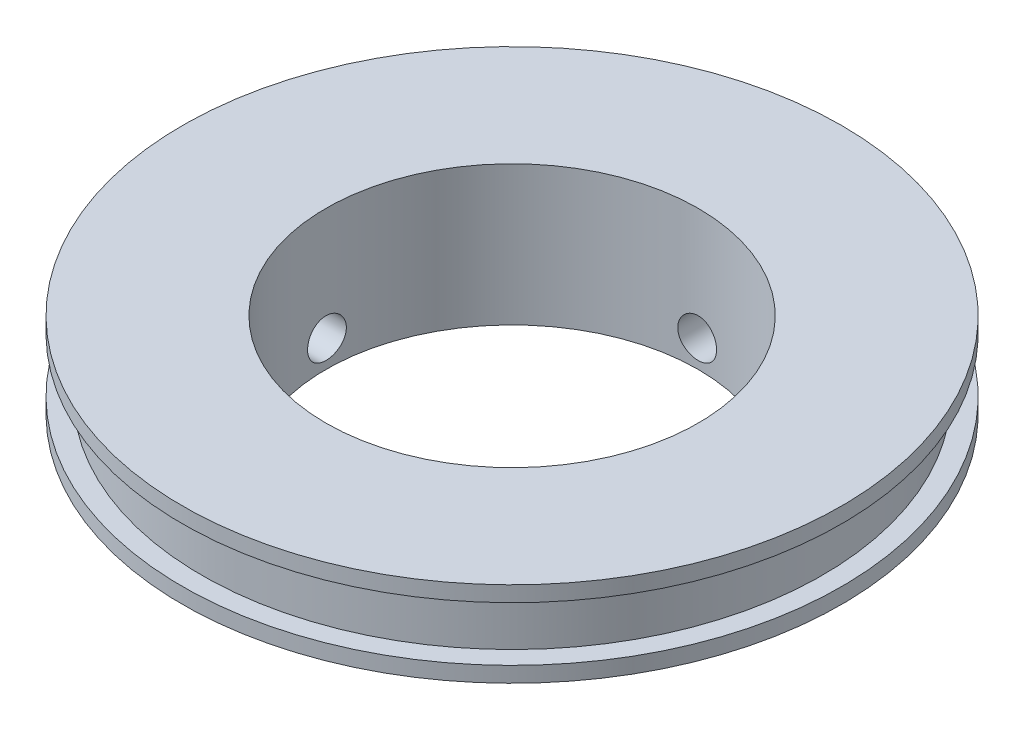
ISO-10303-21;
HEADER;
FILE_DESCRIPTION(('STEP AP214'),'2;1');
FILE_NAME('part.step','',(''),(''),'','','');
FILE_SCHEMA(('AUTOMOTIVE_DESIGN { 1 0 10303 214 1 1 1 1 }'));
ENDSEC;
DATA;
#1=APPLICATION_CONTEXT('core data for automotive mechanical design processes');
#2=APPLICATION_PROTOCOL_DEFINITION('international standard','automotive_design',2000,#1);
#3=PRODUCT_CONTEXT('',#1,'mechanical');
#4=PRODUCT('Part','Part','',(#3));
#5=PRODUCT_RELATED_PRODUCT_CATEGORY('part','',(#4));
#6=PRODUCT_DEFINITION_FORMATION('','',#4);
#7=PRODUCT_DEFINITION_CONTEXT('part definition',#1,'design');
#8=PRODUCT_DEFINITION('design','',#6,#7);
#9=PRODUCT_DEFINITION_SHAPE('','',#8);
#10=(LENGTH_UNIT() NAMED_UNIT(*) SI_UNIT(.MILLI.,.METRE.));
#11=(NAMED_UNIT(*) PLANE_ANGLE_UNIT() SI_UNIT($,.RADIAN.));
#12=(NAMED_UNIT(*) SI_UNIT($,.STERADIAN.) SOLID_ANGLE_UNIT());
#13=UNCERTAINTY_MEASURE_WITH_UNIT(LENGTH_MEASURE(1.E-05),#10,'distance_accuracy_value','');
#14=(GEOMETRIC_REPRESENTATION_CONTEXT(3) GLOBAL_UNCERTAINTY_ASSIGNED_CONTEXT((#13)) GLOBAL_UNIT_ASSIGNED_CONTEXT((#10,
#11,#12)) REPRESENTATION_CONTEXT('',''));
#15=CARTESIAN_POINT('',(0.,0.,0.));
#16=DIRECTION('',(0.,0.,1.));
#17=DIRECTION('',(1.,0.,0.));
#18=AXIS2_PLACEMENT_3D('',#15,#16,#17);
#19=CARTESIAN_POINT('',(0.,0.,0.));
#20=DIRECTION('',(0.,-1.,0.));
#21=DIRECTION('',(0.,0.,-1.));
#22=AXIS2_PLACEMENT_3D('',#19,#20,#21);
#23=CYLINDRICAL_SURFACE('',#22,24.);
#24=CARTESIAN_POINT('',(-23.86943652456,-8.34931506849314,-2.5));
#25=CARTESIAN_POINT('',(-23.8694382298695,-8.20929829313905,-2.49999395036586));
#26=CARTESIAN_POINT('',(-23.8706818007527,-8.0691897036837,-2.48819755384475));
#27=CARTESIAN_POINT('',(-23.8755208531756,-7.79285930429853,-2.4413188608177));
#28=CARTESIAN_POINT('',(-23.8791189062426,-7.65664191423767,-2.40621110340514));
#29=CARTESIAN_POINT('',(-23.8882550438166,-7.39213547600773,-2.3137450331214));
#30=CARTESIAN_POINT('',(-23.8937919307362,-7.26384159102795,-2.25640045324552));
#31=CARTESIAN_POINT('',(-23.9061804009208,-7.01872668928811,-2.12111540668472));
#32=CARTESIAN_POINT('',(-23.9130317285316,-6.90190344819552,-2.04317894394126));
#33=CARTESIAN_POINT('',(-23.9273072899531,-6.68255943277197,-1.86859335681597));
#34=CARTESIAN_POINT('',(-23.9347334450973,-6.58009015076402,-1.77187968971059));
#35=CARTESIAN_POINT('',(-23.9493045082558,-6.39280640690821,-1.56262316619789));
#36=CARTESIAN_POINT('',(-23.956449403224,-6.30799276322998,-1.45007957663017));
#37=CARTESIAN_POINT('',(-23.9696720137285,-6.15824866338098,-1.21204098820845));
#38=CARTESIAN_POINT('',(-23.9757472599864,-6.09336396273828,-1.08651705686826));
#39=CARTESIAN_POINT('',(-23.9861251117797,-5.98561235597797,-0.826281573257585));
#40=CARTESIAN_POINT('',(-23.9904277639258,-5.94274487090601,-0.691570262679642));
#41=CARTESIAN_POINT('',(-23.9967621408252,-5.8803960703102,-0.417305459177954));
#42=CARTESIAN_POINT('',(-23.998802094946,-5.86082998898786,-0.277771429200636));
#43=CARTESIAN_POINT('',(-24.0004092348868,-5.84537706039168,0.00261381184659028));
#44=CARTESIAN_POINT('',(-23.9999764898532,-5.84948955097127,0.14346498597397));
#45=CARTESIAN_POINT('',(-23.9966937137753,-5.88120835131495,0.421910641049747));
#46=CARTESIAN_POINT('',(-23.9938530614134,-5.90872351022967,0.559515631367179));
#47=CARTESIAN_POINT('',(-23.9860844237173,-5.98632451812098,0.82814388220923));
#48=CARTESIAN_POINT('',(-23.981156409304,-6.03641068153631,0.959167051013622));
#49=CARTESIAN_POINT('',(-23.9697508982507,-6.1578314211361,1.21119893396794));
#50=CARTESIAN_POINT('',(-23.9632704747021,-6.2292061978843,1.33218814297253));
#51=CARTESIAN_POINT('',(-23.9494869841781,-6.39114889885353,1.56050484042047));
#52=CARTESIAN_POINT('',(-23.9421838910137,-6.4817174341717,1.66783189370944));
#53=CARTESIAN_POINT('',(-23.9275333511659,-6.67998906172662,1.86631179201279));
#54=CARTESIAN_POINT('',(-23.9201858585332,-6.78777146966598,1.95738541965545));
#55=CARTESIAN_POINT('',(-23.9063091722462,-7.01713668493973,2.12015956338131));
#56=CARTESIAN_POINT('',(-23.8997799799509,-7.13871951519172,2.19186004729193));
#57=CARTESIAN_POINT('',(-23.8882786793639,-7.39229662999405,2.31385294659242));
#58=CARTESIAN_POINT('',(-23.8833069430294,-7.52429339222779,2.36414024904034));
#59=CARTESIAN_POINT('',(-23.8754910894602,-7.79492039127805,2.44181548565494));
#60=CARTESIAN_POINT('',(-23.8726469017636,-7.93355040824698,2.4692041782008));
#61=CARTESIAN_POINT('',(-23.8694204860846,-8.2128126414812,2.50020237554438));
#62=CARTESIAN_POINT('',(-23.8690267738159,-8.35343241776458,2.50392280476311));
#63=CARTESIAN_POINT('',(-23.8707155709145,-8.63329336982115,2.48777038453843));
#64=CARTESIAN_POINT('',(-23.8727980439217,-8.77253456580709,2.46789788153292));
#65=CARTESIAN_POINT('',(-23.8791941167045,-9.0453611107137,2.40521659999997));
#66=CARTESIAN_POINT('',(-23.8835025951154,-9.17895868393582,2.36246046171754));
#67=CARTESIAN_POINT('',(-23.8938610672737,-9.4370859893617,2.25527940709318));
#68=CARTESIAN_POINT('',(-23.899911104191,-9.5616154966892,2.19085395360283));
#69=CARTESIAN_POINT('',(-23.9130987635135,-9.79857676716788,2.04188597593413));
#70=CARTESIAN_POINT('',(-23.9202403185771,-9.91096217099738,1.95727006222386));
#71=CARTESIAN_POINT('',(-23.934793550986,-10.1199744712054,1.7704280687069));
#72=CARTESIAN_POINT('',(-23.9422052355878,-10.2166009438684,1.66820151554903));
#73=CARTESIAN_POINT('',(-23.9564983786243,-10.3917361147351,1.44855835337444));
#74=CARTESIAN_POINT('',(-23.9633776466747,-10.4701723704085,1.33108381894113));
#75=CARTESIAN_POINT('',(-23.9757988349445,-10.6062016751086,1.0845648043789));
#76=CARTESIAN_POINT('',(-23.9813407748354,-10.6637950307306,0.955520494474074));
#77=CARTESIAN_POINT('',(-23.9904530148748,-10.7563813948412,0.689776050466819));
#78=CARTESIAN_POINT('',(-23.9940271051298,-10.7914178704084,0.553091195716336));
#79=CARTESIAN_POINT('',(-23.9988165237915,-10.8380377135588,0.275739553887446));
#80=CARTESIAN_POINT('',(-24.000031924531,-10.8496218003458,0.135072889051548));
#81=CARTESIAN_POINT('',(-23.9999669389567,-10.8489974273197,-0.145538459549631));
#82=CARTESIAN_POINT('',(-23.9986983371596,-10.8369013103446,-0.285483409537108));
#83=CARTESIAN_POINT('',(-23.993831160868,-10.7894958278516,-0.561341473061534));
#84=CARTESIAN_POINT('',(-23.9902325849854,-10.7541864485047,-0.697254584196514));
#85=CARTESIAN_POINT('',(-23.9811085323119,-10.6613885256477,-0.961187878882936));
#86=CARTESIAN_POINT('',(-23.975583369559,-10.6039035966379,-1.08920934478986));
#87=CARTESIAN_POINT('',(-23.9632214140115,-10.4683982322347,-1.33380446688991));
#88=CARTESIAN_POINT('',(-23.9563846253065,-10.3903778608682,-1.45037815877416));
#89=CARTESIAN_POINT('',(-23.9421261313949,-10.2155957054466,-1.66934422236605));
#90=CARTESIAN_POINT('',(-23.9347019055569,-10.1187502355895,-1.77166963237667));
#91=CARTESIAN_POINT('',(-23.9201264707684,-9.90923403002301,-1.95866561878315));
#92=CARTESIAN_POINT('',(-23.912975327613,-9.79655951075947,-2.04333196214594));
#93=CARTESIAN_POINT('',(-23.8997348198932,-9.55824300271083,-2.19279226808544));
#94=CARTESIAN_POINT('',(-23.8936484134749,-9.43256638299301,-2.25753123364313));
#95=CARTESIAN_POINT('',(-23.8832616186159,-9.17214145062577,-2.36489971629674));
#96=CARTESIAN_POINT('',(-23.8789592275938,-9.03740350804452,-2.40755403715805));
#97=CARTESIAN_POINT('',(-23.8737065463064,-8.80981259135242,-2.4589695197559));
#98=CARTESIAN_POINT('',(-23.872112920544,-8.71841195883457,-2.47433475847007));
#99=CARTESIAN_POINT('',(-23.8699773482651,-8.53445928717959,-2.49485197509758));
#100=CARTESIAN_POINT('',(-23.86943539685,-8.44190725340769,-2.5000040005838));
#101=CARTESIAN_POINT('',(-23.86943652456,-8.34931506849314,-2.5));
#102=B_SPLINE_CURVE_WITH_KNOTS('',3,(#24,#25,#26,#27,#28,#29,#30,#31,#32,#33,#34,#35,#36,#37,
#38,#39,#40,#41,#42,#43,#44,#45,#46,#47,#48,#49,#50,#51,#52,#53,#54,#55,#56,#57,#58,#59,#60,#61,
#62,#63,#64,#65,#66,#67,#68,#69,#70,#71,#72,#73,#74,#75,#76,#77,#78,#79,#80,#81,#82,#83,#84,#85,
#86,#87,#88,#89,#90,#91,#92,#93,#94,#95,#96,#97,#98,#99,#100,#101),.UNSPECIFIED.,.T.,.F.,(4,2,2,
2,2,2,2,2,2,2,2,2,2,2,2,2,2,2,2,2,2,2,2,2,2,2,2,2,2,2,2,2,2,2,2,2,2,2,4),(0.,0.419712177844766,
0.839883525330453,1.25979579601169,1.67962647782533,2.10092663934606,2.52224631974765,
2.94452621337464,3.36679500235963,3.78752292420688,4.20823908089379,4.62732405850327,
5.04641487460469,5.46630215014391,5.88620279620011,6.30809719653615,6.72999229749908,
7.15198808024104,7.57396988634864,7.9939725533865,8.41396905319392,8.83300354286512,
9.2520484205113,9.67264031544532,10.0932435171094,10.515494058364,10.9377383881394,
11.3591665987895,11.7805818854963,12.2000027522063,12.6194238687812,13.0387766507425,
13.4581281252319,13.8793882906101,14.3007493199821,14.7232630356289,15.1453011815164,
15.4228554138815,15.7004083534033),.UNSPECIFIED.);
#103=CARTESIAN_POINT('',(-23.86943652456,-8.34931506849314,-2.5));
#104=VERTEX_POINT('',#103);
#105=EDGE_CURVE('E68',#104,#104,#102,.T.);
#106=ORIENTED_EDGE('',*,*,#105,.F.);
#107=EDGE_LOOP('',(#106));
#108=FACE_BOUND('',#107,.T.);
#109=CARTESIAN_POINT('',(0.,-5.84931506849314,-24.));
#110=CARTESIAN_POINT('',(-0.140019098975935,-5.84932111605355,-23.9999983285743));
#111=CARTESIAN_POINT('',(-0.280130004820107,-5.86111789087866,-23.9987616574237));
#112=CARTESIAN_POINT('',(-0.556465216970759,-5.90799822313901,-23.9939472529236));
#113=CARTESIAN_POINT('',(-0.692685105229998,-5.9431072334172,-23.9903669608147));
#114=CARTESIAN_POINT('',(-0.957196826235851,-6.03557696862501,-23.9812693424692));
#115=CARTESIAN_POINT('',(-1.08549347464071,-6.09292402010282,-23.9757532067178));
#116=CARTESIAN_POINT('',(-1.33061300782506,-6.22821488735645,-23.9634002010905));
#117=CARTESIAN_POINT('',(-1.44743812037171,-6.30615469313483,-23.9565635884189));
#118=CARTESIAN_POINT('',(-1.66678002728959,-6.48074365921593,-23.9423053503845));
#119=CARTESIAN_POINT('',(-1.76924592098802,-6.57745661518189,-23.9348817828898));
#120=CARTESIAN_POINT('',(-1.95652312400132,-6.78671029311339,-23.9203023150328));
#121=CARTESIAN_POINT('',(-2.04133360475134,-6.89925175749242,-23.9131464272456));
#122=CARTESIAN_POINT('',(-2.1910743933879,-7.13728847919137,-23.8998928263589));
#123=CARTESIAN_POINT('',(-2.25595836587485,-7.26281303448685,-23.8937975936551));
#124=CARTESIAN_POINT('',(-2.36370845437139,-7.52304987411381,-23.8833797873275));
#125=CARTESIAN_POINT('',(-2.40657515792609,-7.65776191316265,-23.8790571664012));
#126=CARTESIAN_POINT('',(-2.46892233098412,-7.93202896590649,-23.8726917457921));
#127=CARTESIAN_POINT('',(-2.48848749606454,-8.0715645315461,-23.8706406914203));
#128=CARTESIAN_POINT('',(-2.50393806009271,-8.35195278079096,-23.8690250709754));
#129=CARTESIAN_POINT('',(-2.49982413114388,-8.49280542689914,-23.8694604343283));
#130=CARTESIAN_POINT('',(-2.4681030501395,-8.77124474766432,-23.8727609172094));
#131=CARTESIAN_POINT('',(-2.44058849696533,-8.90884210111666,-23.8756164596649));
#132=CARTESIAN_POINT('',(-2.36299134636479,-9.17745539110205,-23.8834205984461));
#133=CARTESIAN_POINT('',(-2.312908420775,-9.30847123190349,-23.888369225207));
#134=CARTESIAN_POINT('',(-2.19149439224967,-9.56049421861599,-23.8998129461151));
#135=CARTESIAN_POINT('',(-2.12012233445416,-9.68148149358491,-23.906311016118));
#136=CARTESIAN_POINT('',(-1.95818544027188,-9.90979547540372,-23.9201189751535));
#137=CARTESIAN_POINT('',(-1.86761999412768,-10.0171217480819,-23.9274288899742));
#138=CARTESIAN_POINT('',(-1.66935056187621,-10.2156051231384,-23.9420795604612));
#139=CARTESIAN_POINT('',(-1.56156662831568,-10.3066823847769,-23.9494202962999));
#140=CARTESIAN_POINT('',(-1.33219706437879,-10.4694631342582,-23.9632725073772));
#141=CARTESIAN_POINT('',(-1.21061141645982,-10.5411665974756,-23.9697839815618));
#142=CARTESIAN_POINT('',(-0.957033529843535,-10.6631616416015,-23.9812464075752));
#143=CARTESIAN_POINT('',(-0.825039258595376,-10.7134490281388,-23.9861970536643));
#144=CARTESIAN_POINT('',(-0.554417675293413,-10.7911251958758,-23.9939769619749));
#145=CARTESIAN_POINT('',(-0.415790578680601,-10.8185147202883,-23.9968062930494));
#146=CARTESIAN_POINT('',(-0.136529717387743,-10.849516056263,-24.0000159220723));
#147=CARTESIAN_POINT('',(0.0040916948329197,-10.8532380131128,-24.0004075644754));
#148=CARTESIAN_POINT('',(0.283956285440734,-10.8370880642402,-23.9987281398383));
#149=CARTESIAN_POINT('',(0.423199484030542,-10.8172165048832,-23.9966571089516));
#150=CARTESIAN_POINT('',(0.696036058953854,-10.7545350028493,-23.990292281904));
#151=CARTESIAN_POINT('',(0.829641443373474,-10.7117767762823,-23.9860034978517));
#152=CARTESIAN_POINT('',(1.08778344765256,-10.6045889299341,-23.9756841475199));
#153=CARTESIAN_POINT('',(1.21231984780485,-10.5401587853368,-23.9696535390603));
#154=CARTESIAN_POINT('',(1.44928583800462,-10.3911838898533,-23.9564964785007));
#155=CARTESIAN_POINT('',(1.56166981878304,-10.3065669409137,-23.9493661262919));
#156=CARTESIAN_POINT('',(1.7706787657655,-10.1197237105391,-23.9348217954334));
#157=CARTESIAN_POINT('',(1.86730330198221,-10.017496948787,-23.9274078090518));
#158=CARTESIAN_POINT('',(2.04243425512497,-9.79785462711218,-23.9130975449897));
#159=CARTESIAN_POINT('',(2.12086827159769,-9.68038117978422,-23.906203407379));
#160=CARTESIAN_POINT('',(2.25689364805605,-9.43386493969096,-23.8937463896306));
#161=CARTESIAN_POINT('',(2.31448531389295,-9.30482231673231,-23.8881834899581));
#162=CARTESIAN_POINT('',(2.4070705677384,-9.03907683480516,-23.8790323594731));
#163=CARTESIAN_POINT('',(2.4421068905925,-8.90238899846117,-23.8754403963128));
#164=CARTESIAN_POINT('',(2.48872541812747,-8.62503106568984,-23.8706263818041));
#165=CARTESIAN_POINT('',(2.50030835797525,-8.48436109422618,-23.8694042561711));
#166=CARTESIAN_POINT('',(2.49968062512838,-8.20375168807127,-23.8694699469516));
#167=CARTESIAN_POINT('',(2.48758368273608,-8.06381198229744,-23.8707457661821));
#168=CARTESIAN_POINT('',(2.44017839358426,-7.7879646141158,-23.8756379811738));
#169=CARTESIAN_POINT('',(2.40487002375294,-7.65205695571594,-23.8792543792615));
#170=CARTESIAN_POINT('',(2.31207619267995,-7.3881346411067,-23.8884168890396));
#171=CARTESIAN_POINT('',(2.25459440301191,-7.26011868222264,-23.8939626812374));
#172=CARTESIAN_POINT('',(2.11909702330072,-7.01553326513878,-23.9063597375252));
#173=CARTESIAN_POINT('',(2.04108149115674,-6.89896377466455,-23.9132109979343));
#174=CARTESIAN_POINT('',(1.86630467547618,-6.6799975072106,-23.9274864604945));
#175=CARTESIAN_POINT('',(1.7694585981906,-6.57766857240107,-23.9349131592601));
#176=CARTESIAN_POINT('',(1.55993972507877,-6.39066575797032,-23.9494799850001));
#177=CARTESIAN_POINT('',(1.44726315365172,-6.30599610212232,-23.9566200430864));
#178=CARTESIAN_POINT('',(1.20894495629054,-6.15653221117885,-23.9698294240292));
#179=CARTESIAN_POINT('',(1.08326906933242,-6.09179238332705,-23.9758957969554));
#180=CARTESIAN_POINT('',(0.822845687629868,-5.9844220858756,-23.9862426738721));
#181=CARTESIAN_POINT('',(0.688108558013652,-5.94176682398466,-23.9905251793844));
#182=CARTESIAN_POINT('',(0.46051512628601,-5.89034870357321,-23.9957523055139));
#183=CARTESIAN_POINT('',(0.369110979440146,-5.87498227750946,-23.9973377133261));
#184=CARTESIAN_POINT('',(0.185151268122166,-5.85446348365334,-23.999462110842));
#185=CARTESIAN_POINT('',(0.0925957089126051,-5.84931106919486,-24.0000011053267));
#186=CARTESIAN_POINT('',(0.,-5.84931506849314,-24.));
#187=B_SPLINE_CURVE_WITH_KNOTS('',3,(#109,#110,#111,#112,#113,#114,#115,#116,#117,#118,#119,
#120,#121,#122,#123,#124,#125,#126,#127,#128,#129,#130,#131,#132,#133,#134,#135,#136,#137,#138,
#139,#140,#141,#142,#143,#144,#145,#146,#147,#148,#149,#150,#151,#152,#153,#154,#155,#156,#157,
#158,#159,#160,#161,#162,#163,#164,#165,#166,#167,#168,#169,#170,#171,#172,#173,#174,#175,#176,
#177,#178,#179,#180,#181,#182,#183,#184,#185,#186),.UNSPECIFIED.,.T.,.F.,(4,2,2,2,2,2,2,2,2,2,2,
2,2,2,2,2,2,2,2,2,2,2,2,2,2,2,2,2,2,2,2,2,2,2,2,2,2,2,4),(0.,0.41971915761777,0.839897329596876,
1.25981755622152,1.67965607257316,2.1009470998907,2.52225789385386,2.94454107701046,
3.3668129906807,3.78754531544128,4.2082656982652,4.62732894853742,5.04639829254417,
5.46627907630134,5.88617320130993,6.30807685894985,6.7299810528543,7.15196783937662,
7.5739409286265,7.99394877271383,8.41395045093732,8.83300704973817,9.2520737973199,
9.67266241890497,10.0932625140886,10.5155089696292,10.9377492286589,11.3591871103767,
11.7806117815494,12.2000173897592,12.6194234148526,13.0387600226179,13.4580954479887,
13.8793647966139,14.3007347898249,14.7232451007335,15.1452800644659,15.4228448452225,
15.7004083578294),.UNSPECIFIED.);
#188=CARTESIAN_POINT('',(0.,-5.84931506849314,-24.));
#189=VERTEX_POINT('',#188);
#190=EDGE_CURVE('E67',#189,#189,#187,.T.);
#191=ORIENTED_EDGE('',*,*,#190,.F.);
#192=EDGE_LOOP('',(#191));
#193=FACE_BOUND('',#192,.T.);
#194=CARTESIAN_POINT('',(0.,-11.8493150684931,0.));
#195=DIRECTION('',(0.,-1.,0.));
#196=DIRECTION('',(0.,0.,-1.));
#197=AXIS2_PLACEMENT_3D('',#194,#195,#196);
#198=CIRCLE('',#197,24.);
#199=CARTESIAN_POINT('',(0.,-11.8493150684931,-24.));
#200=VERTEX_POINT('',#199);
#201=EDGE_CURVE('E89',#200,#200,#198,.T.);
#202=ORIENTED_EDGE('',*,*,#201,.T.);
#203=EDGE_LOOP('',(#202));
#204=FACE_BOUND('',#203,.T.);
#205=CARTESIAN_POINT('',(0.,6.15068493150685,0.));
#206=DIRECTION('',(0.,-1.,0.));
#207=DIRECTION('',(0.,0.,-1.));
#208=AXIS2_PLACEMENT_3D('',#205,#206,#207);
#209=CIRCLE('',#208,24.);
#210=CARTESIAN_POINT('',(0.,6.15068493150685,-24.));
#211=VERTEX_POINT('',#210);
#212=EDGE_CURVE('E10',#211,#211,#209,.T.);
#213=ORIENTED_EDGE('',*,*,#212,.F.);
#214=EDGE_LOOP('',(#213));
#215=FACE_BOUND('',#214,.T.);
#216=ADVANCED_FACE('F37',(#108,#193,#204,#215),#23,.F.);
#217=CARTESIAN_POINT('',(24.,6.15068493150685,0.));
#218=DIRECTION('',(0.,1.,0.));
#219=DIRECTION('',(0.,0.,1.));
#220=AXIS2_PLACEMENT_3D('',#217,#218,#219);
#221=PLANE('',#220);
#222=ORIENTED_EDGE('',*,*,#212,.T.);
#223=EDGE_LOOP('',(#222));
#224=FACE_BOUND('',#223,.T.);
#225=CARTESIAN_POINT('',(0.,6.15068493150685,0.));
#226=DIRECTION('',(0.,-1.,0.));
#227=DIRECTION('',(0.,0.,-1.));
#228=AXIS2_PLACEMENT_3D('',#225,#226,#227);
#229=CIRCLE('',#228,42.5);
#230=CARTESIAN_POINT('',(0.,6.15068493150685,-42.5));
#231=VERTEX_POINT('',#230);
#232=EDGE_CURVE('E51',#231,#231,#229,.T.);
#233=ORIENTED_EDGE('',*,*,#232,.F.);
#234=EDGE_LOOP('',(#233));
#235=FACE_BOUND('',#234,.T.);
#236=ADVANCED_FACE('F128',(#224,#235),#221,.T.);
#237=CARTESIAN_POINT('',(0.,0.,0.));
#238=DIRECTION('',(0.,-1.,0.));
#239=DIRECTION('',(0.,0.,-1.));
#240=AXIS2_PLACEMENT_3D('',#237,#238,#239);
#241=CYLINDRICAL_SURFACE('',#240,42.5);
#242=ORIENTED_EDGE('',*,*,#232,.T.);
#243=EDGE_LOOP('',(#242));
#244=FACE_BOUND('',#243,.T.);
#245=CARTESIAN_POINT('',(0.,4.15068493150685,0.));
#246=DIRECTION('',(0.,-1.,0.));
#247=DIRECTION('',(0.,0.,-1.));
#248=AXIS2_PLACEMENT_3D('',#245,#246,#247);
#249=CIRCLE('',#248,42.5);
#250=CARTESIAN_POINT('',(0.,4.15068493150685,-42.5));
#251=VERTEX_POINT('',#250);
#252=EDGE_CURVE('E57',#251,#251,#249,.T.);
#253=ORIENTED_EDGE('',*,*,#252,.F.);
#254=EDGE_LOOP('',(#253));
#255=FACE_BOUND('',#254,.T.);
#256=ADVANCED_FACE('F126',(#244,#255),#241,.T.);
#257=CARTESIAN_POINT('',(42.5,4.15068493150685,0.));
#258=DIRECTION('',(0.,-1.,0.));
#259=DIRECTION('',(0.,0.,-1.));
#260=AXIS2_PLACEMENT_3D('',#257,#258,#259);
#261=PLANE('',#260);
#262=ORIENTED_EDGE('',*,*,#252,.T.);
#263=EDGE_LOOP('',(#262));
#264=FACE_BOUND('',#263,.T.);
#265=CARTESIAN_POINT('',(0.,4.15068493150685,0.));
#266=DIRECTION('',(0.,-1.,0.));
#267=DIRECTION('',(0.,0.,-1.));
#268=AXIS2_PLACEMENT_3D('',#265,#266,#267);
#269=CIRCLE('',#268,40.);
#270=CARTESIAN_POINT('',(0.,4.15068493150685,-40.));
#271=VERTEX_POINT('',#270);
#272=EDGE_CURVE('E116',#271,#271,#269,.T.);
#273=ORIENTED_EDGE('',*,*,#272,.F.);
#274=EDGE_LOOP('',(#273));
#275=FACE_BOUND('',#274,.T.);
#276=ADVANCED_FACE('F123',(#264,#275),#261,.T.);
#277=CARTESIAN_POINT('',(0.,0.,0.));
#278=DIRECTION('',(0.,-1.,0.));
#279=DIRECTION('',(0.,0.,-1.));
#280=AXIS2_PLACEMENT_3D('',#277,#278,#279);
#281=CYLINDRICAL_SURFACE('',#280,40.);
#282=ORIENTED_EDGE('',*,*,#272,.T.);
#283=EDGE_LOOP('',(#282));
#284=FACE_BOUND('',#283,.T.);
#285=CARTESIAN_POINT('',(0.,-2.84931506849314,0.));
#286=DIRECTION('',(0.,-1.,0.));
#287=DIRECTION('',(0.,0.,-1.));
#288=AXIS2_PLACEMENT_3D('',#285,#286,#287);
#289=CIRCLE('',#288,40.);
#290=CARTESIAN_POINT('',(0.,-2.84931506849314,-40.));
#291=VERTEX_POINT('',#290);
#292=EDGE_CURVE('E112',#291,#291,#289,.T.);
#293=ORIENTED_EDGE('',*,*,#292,.F.);
#294=EDGE_LOOP('',(#293));
#295=FACE_BOUND('',#294,.T.);
#296=ADVANCED_FACE('F135',(#284,#295),#281,.T.);
#297=CARTESIAN_POINT('',(40.,-2.84931506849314,0.));
#298=DIRECTION('',(0.,1.,0.));
#299=DIRECTION('',(0.,0.,1.));
#300=AXIS2_PLACEMENT_3D('',#297,#298,#299);
#301=PLANE('',#300);
#302=ORIENTED_EDGE('',*,*,#292,.T.);
#303=EDGE_LOOP('',(#302));
#304=FACE_BOUND('',#303,.T.);
#305=CARTESIAN_POINT('',(0.,-2.84931506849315,0.));
#306=DIRECTION('',(0.,-1.,0.));
#307=DIRECTION('',(0.,0.,-1.));
#308=AXIS2_PLACEMENT_3D('',#305,#306,#307);
#309=CIRCLE('',#308,42.5);
#310=CARTESIAN_POINT('',(0.,-2.84931506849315,-42.5));
#311=VERTEX_POINT('',#310);
#312=EDGE_CURVE('E108',#311,#311,#309,.T.);
#313=ORIENTED_EDGE('',*,*,#312,.F.);
#314=EDGE_LOOP('',(#313));
#315=FACE_BOUND('',#314,.T.);
#316=ADVANCED_FACE('F210',(#304,#315),#301,.T.);
#317=CARTESIAN_POINT('',(0.,0.,0.));
#318=DIRECTION('',(0.,-1.,0.));
#319=DIRECTION('',(0.,0.,-1.));
#320=AXIS2_PLACEMENT_3D('',#317,#318,#319);
#321=CYLINDRICAL_SURFACE('',#320,42.5);
#322=ORIENTED_EDGE('',*,*,#312,.T.);
#323=EDGE_LOOP('',(#322));
#324=FACE_BOUND('',#323,.T.);
#325=CARTESIAN_POINT('',(0.,-4.84931506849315,0.));
#326=DIRECTION('',(0.,-1.,0.));
#327=DIRECTION('',(0.,0.,-1.));
#328=AXIS2_PLACEMENT_3D('',#325,#326,#327);
#329=CIRCLE('',#328,42.5);
#330=CARTESIAN_POINT('',(0.,-4.84931506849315,-42.5));
#331=VERTEX_POINT('',#330);
#332=EDGE_CURVE('E104',#331,#331,#329,.T.);
#333=ORIENTED_EDGE('',*,*,#332,.F.);
#334=EDGE_LOOP('',(#333));
#335=FACE_BOUND('',#334,.T.);
#336=ADVANCED_FACE('F161',(#324,#335),#321,.T.);
#337=CARTESIAN_POINT('',(42.5,-4.84931506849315,0.));
#338=DIRECTION('',(0.,-1.,0.));
#339=DIRECTION('',(0.,0.,-1.));
#340=AXIS2_PLACEMENT_3D('',#337,#338,#339);
#341=PLANE('',#340);
#342=ORIENTED_EDGE('',*,*,#332,.T.);
#343=EDGE_LOOP('',(#342));
#344=FACE_BOUND('',#343,.T.);
#345=CARTESIAN_POINT('',(0.,-4.84931506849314,0.));
#346=DIRECTION('',(0.,-1.,0.));
#347=DIRECTION('',(0.,0.,-1.));
#348=AXIS2_PLACEMENT_3D('',#345,#346,#347);
#349=CIRCLE('',#348,30.);
#350=CARTESIAN_POINT('',(0.,-4.84931506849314,-30.));
#351=VERTEX_POINT('',#350);
#352=EDGE_CURVE('E100',#351,#351,#349,.T.);
#353=ORIENTED_EDGE('',*,*,#352,.F.);
#354=EDGE_LOOP('',(#353));
#355=FACE_BOUND('',#354,.T.);
#356=ADVANCED_FACE('F154',(#344,#355),#341,.T.);
#357=CARTESIAN_POINT('',(0.,0.,0.));
#358=DIRECTION('',(0.,-1.,0.));
#359=DIRECTION('',(0.,0.,-1.));
#360=AXIS2_PLACEMENT_3D('',#357,#358,#359);
#361=CYLINDRICAL_SURFACE('',#360,30.);
#362=CARTESIAN_POINT('',(-29.8956518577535,-8.34931506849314,-2.5));
#363=CARTESIAN_POINT('',(-29.895653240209,-8.48947934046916,-2.49999387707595));
#364=CARTESIAN_POINT('',(-29.8966481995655,-8.62973903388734,-2.48817272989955));
#365=CARTESIAN_POINT('',(-29.9005204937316,-8.90637761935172,-2.44118994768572));
#366=CARTESIAN_POINT('',(-29.9033999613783,-9.04275193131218,-2.40600186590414));
#367=CARTESIAN_POINT('',(-29.9107128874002,-9.30757305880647,-2.31330996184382));
#368=CARTESIAN_POINT('',(-29.9151454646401,-9.43602432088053,-2.25581879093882));
#369=CARTESIAN_POINT('',(-29.9250640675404,-9.68142305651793,-2.12017517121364));
#370=CARTESIAN_POINT('',(-29.9305498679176,-9.79837298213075,-2.04202713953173));
#371=CARTESIAN_POINT('',(-29.9419726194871,-10.0177800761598,-1.86707134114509));
#372=CARTESIAN_POINT('',(-29.9479105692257,-10.1202036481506,-1.7702215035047));
#373=CARTESIAN_POINT('',(-29.9595594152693,-10.3073619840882,-1.56070030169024));
#374=CARTESIAN_POINT('',(-29.9652703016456,-10.3920959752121,-1.4480282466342));
#375=CARTESIAN_POINT('',(-29.9758310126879,-10.5415816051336,-1.20986061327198));
#376=CARTESIAN_POINT('',(-29.9806795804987,-10.6063041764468,-1.08434673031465));
#377=CARTESIAN_POINT('',(-29.9889585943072,-10.7137437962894,-0.824186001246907));
#378=CARTESIAN_POINT('',(-29.9923890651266,-10.7564612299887,-0.689539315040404));
#379=CARTESIAN_POINT('',(-29.9974383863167,-10.8185812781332,-0.415269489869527));
#380=CARTESIAN_POINT('',(-29.9990614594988,-10.8380382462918,-0.275658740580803));
#381=CARTESIAN_POINT('',(-30.0003274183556,-10.8532530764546,0.0048557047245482));
#382=CARTESIAN_POINT('',(-29.999970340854,-10.8490113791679,0.145759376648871));
#383=CARTESIAN_POINT('',(-29.9973197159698,-10.8169937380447,0.424491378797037));
#384=CARTESIAN_POINT('',(-29.9950309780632,-10.7892762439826,0.562326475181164));
#385=CARTESIAN_POINT('',(-29.9887799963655,-10.7111846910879,0.831381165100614));
#386=CARTESIAN_POINT('',(-29.9848177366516,-10.6608104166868,0.962600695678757));
#387=CARTESIAN_POINT('',(-29.9756571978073,-10.5387701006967,1.21488540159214));
#388=CARTESIAN_POINT('',(-29.9704574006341,-10.4670778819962,1.33593785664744));
#389=CARTESIAN_POINT('',(-29.9594061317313,-10.3044557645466,1.56431333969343));
#390=CARTESIAN_POINT('',(-29.9535546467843,-10.2135254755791,1.67163608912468));
#391=CARTESIAN_POINT('',(-29.9418366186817,-10.014678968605,1.86984741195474));
#392=CARTESIAN_POINT('',(-29.9359700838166,-9.90671196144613,1.96068504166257));
#393=CARTESIAN_POINT('',(-29.9249010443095,-9.67703380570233,2.12295399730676));
#394=CARTESIAN_POINT('',(-29.9196985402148,-9.55532264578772,2.19438530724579));
#395=CARTESIAN_POINT('',(-29.9105456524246,-9.30157534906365,2.31581201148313));
#396=CARTESIAN_POINT('',(-29.9065954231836,-9.16953794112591,2.36580476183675));
#397=CARTESIAN_POINT('',(-29.9003973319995,-8.89890327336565,2.44289751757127));
#398=CARTESIAN_POINT('',(-29.898149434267,-8.76030615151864,2.46999800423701));
#399=CARTESIAN_POINT('',(-29.8956163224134,-8.48093210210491,2.50047245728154));
#400=CARTESIAN_POINT('',(-29.895325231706,-8.34016297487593,2.50391746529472));
#401=CARTESIAN_POINT('',(-29.8967231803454,-8.06004920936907,2.48716926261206));
#402=CARTESIAN_POINT('',(-29.898412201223,-7.92070455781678,2.46697627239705));
#403=CARTESIAN_POINT('',(-29.9035747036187,-7.64759917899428,2.4035845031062));
#404=CARTESIAN_POINT('',(-29.9070456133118,-7.51383070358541,2.36041887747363));
#405=CARTESIAN_POINT('',(-29.9153786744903,-7.25543486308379,2.2523408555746));
#406=CARTESIAN_POINT('',(-29.9202408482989,-7.13080764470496,2.18742811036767));
#407=CARTESIAN_POINT('',(-29.9308228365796,-6.89390693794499,2.03751871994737));
#408=CARTESIAN_POINT('',(-29.9365446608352,-6.78166349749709,1.95247473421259));
#409=CARTESIAN_POINT('',(-29.9481944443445,-6.57302021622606,1.76478532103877));
#410=CARTESIAN_POINT('',(-29.9541224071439,-6.47662064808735,1.66213959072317));
#411=CARTESIAN_POINT('',(-29.9655340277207,-6.30215905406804,1.44185343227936));
#412=CARTESIAN_POINT('',(-29.9710165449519,-6.22414318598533,1.32417638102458));
#413=CARTESIAN_POINT('',(-29.9809030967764,-6.08898028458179,1.07735048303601));
#414=CARTESIAN_POINT('',(-29.9853071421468,-6.03183304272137,0.948201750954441));
#415=CARTESIAN_POINT('',(-29.9925352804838,-5.94010886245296,0.682263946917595));
#416=CARTESIAN_POINT('',(-29.9953613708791,-5.90550338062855,0.545484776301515));
#417=CARTESIAN_POINT('',(-29.9991232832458,-5.85975175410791,0.268032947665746));
#418=CARTESIAN_POINT('',(-30.0000591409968,-5.84860516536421,0.127360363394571));
#419=CARTESIAN_POINT('',(-29.9999351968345,-5.85009291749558,-0.153430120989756));
#420=CARTESIAN_POINT('',(-29.9988814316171,-5.8626553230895,-0.293548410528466));
#421=CARTESIAN_POINT('',(-29.9949085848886,-5.91105445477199,-0.569677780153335));
#422=CARTESIAN_POINT('',(-29.9919895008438,-5.9468912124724,-0.705688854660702));
#423=CARTESIAN_POINT('',(-29.9846135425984,-6.04080349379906,-0.969747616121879));
#424=CARTESIAN_POINT('',(-29.9801567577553,-6.09887772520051,-1.09779576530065));
#425=CARTESIAN_POINT('',(-29.9702039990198,-6.23560818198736,-1.34233643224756));
#426=CARTESIAN_POINT('',(-29.9647080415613,-6.31426408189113,-1.45882913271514));
#427=CARTESIAN_POINT('',(-29.9532739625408,-6.49019510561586,-1.67732022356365));
#428=CARTESIAN_POINT('',(-29.9473346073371,-6.58752345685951,-1.77927568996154));
#429=CARTESIAN_POINT('',(-29.9356936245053,-6.79794049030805,-1.96544456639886));
#430=CARTESIAN_POINT('',(-29.9299920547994,-6.91103298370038,-2.04965367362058));
#431=CARTESIAN_POINT('',(-29.9194606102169,-7.1499875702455,-2.19805344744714));
#432=CARTESIAN_POINT('',(-29.9146323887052,-7.27587319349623,-2.26220630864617));
#433=CARTESIAN_POINT('',(-29.9064144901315,-7.53658366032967,-2.36838225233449));
#434=CARTESIAN_POINT('',(-29.9030231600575,-7.67139802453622,-2.41043077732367));
#435=CARTESIAN_POINT('',(-29.8989352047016,-7.89739227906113,-2.46049524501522));
#436=CARTESIAN_POINT('',(-29.8977096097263,-7.98711870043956,-2.47528983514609));
#437=CARTESIAN_POINT('',(-29.8960674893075,-8.16765507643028,-2.49504418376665));
#438=CARTESIAN_POINT('',(-29.8956509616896,-8.25846502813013,-2.50000396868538));
#439=CARTESIAN_POINT('',(-29.8956518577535,-8.34931506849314,-2.5));
#440=B_SPLINE_CURVE_WITH_KNOTS('',3,(#362,#363,#364,#365,#366,#367,#368,#369,#370,#371,#372,
#373,#374,#375,#376,#377,#378,#379,#380,#381,#382,#383,#384,#385,#386,#387,#388,#389,#390,#391,
#392,#393,#394,#395,#396,#397,#398,#399,#400,#401,#402,#403,#404,#405,#406,#407,#408,#409,#410,
#411,#412,#413,#414,#415,#416,#417,#418,#419,#420,#421,#422,#423,#424,#425,#426,#427,#428,#429,
#430,#431,#432,#433,#434,#435,#436,#437,#438,#439),.UNSPECIFIED.,.T.,.F.,(4,2,2,2,2,2,2,2,2,2,2,
2,2,2,2,2,2,2,2,2,2,2,2,2,2,2,2,2,2,2,2,2,2,2,2,2,2,2,4),(0.,0.420161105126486,
0.840798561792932,1.26119776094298,1.68150713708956,2.10277327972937,2.52405782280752,
2.94595145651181,3.36783770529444,3.78873617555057,4.20962681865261,4.62947260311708,
5.04932238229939,5.46968985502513,5.89006585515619,6.31171960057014,6.73337369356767,
7.15507977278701,7.57677698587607,7.99720721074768,8.4176335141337,8.83745470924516,
9.25728264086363,9.67810782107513,10.0989402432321,10.5208182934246,10.9426921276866,
11.3640307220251,11.7853613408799,12.2054156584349,12.62547054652,13.0455010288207,
13.4655248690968,13.8867643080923,14.3081057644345,14.7302367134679,15.1518807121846,
15.42421656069,15.6965516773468),.UNSPECIFIED.);
#441=CARTESIAN_POINT('',(-29.8956518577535,-8.34931506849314,-2.5));
#442=VERTEX_POINT('',#441);
#443=EDGE_CURVE('E41',#442,#442,#440,.T.);
#444=ORIENTED_EDGE('',*,*,#443,.F.);
#445=EDGE_LOOP('',(#444));
#446=FACE_BOUND('',#445,.T.);
#447=CARTESIAN_POINT('',(0.,-5.84931506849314,-30.));
#448=CARTESIAN_POINT('',(0.140165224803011,-5.84932119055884,-29.9999986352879));
#449=CARTESIAN_POINT('',(0.280425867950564,-5.86114249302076,-29.9990072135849));
#450=CARTESIAN_POINT('',(0.557066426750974,-5.90812594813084,-29.9951475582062));
#451=CARTESIAN_POINT('',(0.693441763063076,-5.9433145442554,-29.9922771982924));
#452=CARTESIAN_POINT('',(0.958265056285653,-6.03600795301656,-29.9849840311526));
#453=CARTESIAN_POINT('',(1.08671745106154,-6.09350013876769,-29.9805621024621));
#454=CARTESIAN_POINT('',(1.33211808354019,-6.22914614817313,-29.9706616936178));
#455=CARTESIAN_POINT('',(1.44906877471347,-6.30729555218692,-29.9651834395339));
#456=CARTESIAN_POINT('',(1.66847499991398,-6.48225273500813,-29.9537694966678));
#457=CARTESIAN_POINT('',(1.7708971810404,-6.57910227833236,-29.9478328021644));
#458=CARTESIAN_POINT('',(1.95805283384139,-6.78862230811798,-29.9361795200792));
#459=CARTESIAN_POINT('',(2.04278552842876,-6.9012934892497,-29.930462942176));
#460=CARTESIAN_POINT('',(2.19226980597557,-7.13946036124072,-29.9198863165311));
#461=CARTESIAN_POINT('',(2.25699208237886,-7.26497450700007,-29.9150275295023));
#462=CARTESIAN_POINT('',(2.36443108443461,-7.5251358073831,-29.9067281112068));
#463=CARTESIAN_POINT('',(2.40714819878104,-7.65978280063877,-29.9032874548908));
#464=CARTESIAN_POINT('',(2.46926757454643,-7.93405354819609,-29.898222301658));
#465=CARTESIAN_POINT('',(2.48872416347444,-8.07366491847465,-29.8965935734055));
#466=CARTESIAN_POINT('',(2.50393802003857,-8.35418057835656,-29.8953233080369));
#467=CARTESIAN_POINT('',(2.49969573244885,-8.49508484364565,-29.8956817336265));
#468=CARTESIAN_POINT('',(2.46767716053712,-8.77381423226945,-29.8983414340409));
#469=CARTESIAN_POINT('',(2.43995992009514,-8.91164619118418,-29.9006378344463));
#470=CARTESIAN_POINT('',(2.36186996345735,-9.18069473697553,-29.9069070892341));
#471=CARTESIAN_POINT('',(2.31149702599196,-9.31191125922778,-29.91087995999));
#472=CARTESIAN_POINT('',(2.18945947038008,-9.56419233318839,-29.9200601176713));
#473=CARTESIAN_POINT('',(2.11776836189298,-9.68524401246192,-29.9252689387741));
#474=CARTESIAN_POINT('',(1.95514860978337,-9.91361841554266,-29.936332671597));
#475=CARTESIAN_POINT('',(1.86421957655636,-10.0209408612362,-29.9421875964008));
#476=CARTESIAN_POINT('',(1.66537395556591,-10.2191536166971,-29.9539055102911));
#477=CARTESIAN_POINT('',(1.55740632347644,-10.3099927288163,-29.9597684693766));
#478=CARTESIAN_POINT('',(1.32772639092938,-10.4722643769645,-29.9708247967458));
#479=CARTESIAN_POINT('',(1.20601408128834,-10.543696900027,-29.9760181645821));
#480=CARTESIAN_POINT('',(0.952266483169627,-10.6651244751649,-29.985151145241));
#481=CARTESIAN_POINT('',(0.820230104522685,-10.7151172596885,-29.9890906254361));
#482=CARTESIAN_POINT('',(0.549597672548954,-10.7922103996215,-29.995270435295));
#483=CARTESIAN_POINT('',(0.411001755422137,-10.8193112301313,-29.9975108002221));
#484=CARTESIAN_POINT('',(0.131628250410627,-10.8497869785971,-30.0000354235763));
#485=CARTESIAN_POINT('',(-0.00914157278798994,-10.8532326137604,-30.0003255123));
#486=CARTESIAN_POINT('',(-0.289256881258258,-10.8364854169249,-29.9989324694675));
#487=CARTESIAN_POINT('',(-0.428602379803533,-10.8162928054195,-29.9972493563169));
#488=CARTESIAN_POINT('',(-0.701711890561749,-10.7529009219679,-29.992102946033));
#489=CARTESIAN_POINT('',(-0.835483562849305,-10.7097344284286,-29.9886421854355));
#490=CARTESIAN_POINT('',(-1.09388541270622,-10.6016535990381,-29.9803292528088));
#491=CARTESIAN_POINT('',(-1.21851544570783,-10.5367389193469,-29.9754770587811));
#492=CARTESIAN_POINT('',(-1.45541804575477,-10.3868266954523,-29.9649106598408));
#493=CARTESIAN_POINT('',(-1.56766087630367,-10.3017823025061,-29.9591944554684));
#494=CARTESIAN_POINT('',(-1.77630273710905,-10.1140924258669,-29.9475489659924));
#495=CARTESIAN_POINT('',(-1.87270149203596,-10.01144663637,-29.9416196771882));
#496=CARTESIAN_POINT('',(-2.04716136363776,-9.7911608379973,-29.9301990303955));
#497=CARTESIAN_POINT('',(-2.1251763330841,-9.67348421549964,-29.9247087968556));
#498=CARTESIAN_POINT('',(-2.26033765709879,-9.4266594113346,-29.914803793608));
#499=CARTESIAN_POINT('',(-2.31748422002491,-9.2975113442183,-29.9103890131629));
#500=CARTESIAN_POINT('',(-2.40920794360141,-9.03157309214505,-29.9031410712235));
#501=CARTESIAN_POINT('',(-2.44381335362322,-8.89479270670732,-29.9003059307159));
#502=CARTESIAN_POINT('',(-2.48956442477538,-8.61733831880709,-29.8965316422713));
#503=CARTESIAN_POINT('',(-2.50071053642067,-8.47666439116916,-29.8955924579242));
#504=CARTESIAN_POINT('',(-2.49922140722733,-8.19587475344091,-29.8957169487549));
#505=CARTESIAN_POINT('',(-2.48665867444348,-8.05575865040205,-29.8967745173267));
#506=CARTESIAN_POINT('',(-2.43825965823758,-7.77963373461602,-29.9007603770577));
#507=CARTESIAN_POINT('',(-2.40242333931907,-7.64362492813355,-29.9036886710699));
#508=CARTESIAN_POINT('',(-2.30851277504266,-7.3795706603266,-29.9110844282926));
#509=CARTESIAN_POINT('',(-2.25043983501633,-7.25152473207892,-29.9155518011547));
#510=CARTESIAN_POINT('',(-2.11371264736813,-7.00698796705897,-29.9255224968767));
#511=CARTESIAN_POINT('',(-2.03505872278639,-6.89049694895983,-29.9310258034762));
#512=CARTESIAN_POINT('',(-1.85912985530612,-6.67200572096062,-29.942468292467));
#513=CARTESIAN_POINT('',(-1.76180123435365,-6.57004879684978,-29.9484087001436));
#514=CARTESIAN_POINT('',(-1.55138306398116,-6.38387710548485,-29.960044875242));
#515=CARTESIAN_POINT('',(-1.43828970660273,-6.29966663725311,-29.9657405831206));
#516=CARTESIAN_POINT('',(-1.19933443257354,-6.15126541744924,-29.9762558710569));
#517=CARTESIAN_POINT('',(-1.07344914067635,-6.08711222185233,-29.9810738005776));
#518=CARTESIAN_POINT('',(-0.812739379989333,-5.98093556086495,-29.9892713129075));
#519=CARTESIAN_POINT('',(-0.677925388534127,-5.93888665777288,-29.9926525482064));
#520=CARTESIAN_POINT('',(-0.451930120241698,-5.88882111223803,-29.9967276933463));
#521=CARTESIAN_POINT('',(-0.362202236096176,-5.87402603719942,-29.9979492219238));
#522=CARTESIAN_POINT('',(-0.181662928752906,-5.85427104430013,-29.9995858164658));
#523=CARTESIAN_POINT('',(-0.0908515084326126,-5.84931110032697,-30.0000008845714));
#524=CARTESIAN_POINT('',(0.,-5.84931506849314,-30.));
#525=B_SPLINE_CURVE_WITH_KNOTS('',3,(#447,#448,#449,#450,#451,#452,#453,#454,#455,#456,#457,
#458,#459,#460,#461,#462,#463,#464,#465,#466,#467,#468,#469,#470,#471,#472,#473,#474,#475,#476,
#477,#478,#479,#480,#481,#482,#483,#484,#485,#486,#487,#488,#489,#490,#491,#492,#493,#494,#495,
#496,#497,#498,#499,#500,#501,#502,#503,#504,#505,#506,#507,#508,#509,#510,#511,#512,#513,#514,
#515,#516,#517,#518,#519,#520,#521,#522,#523,#524),.UNSPECIFIED.,.T.,.F.,(4,2,2,2,2,2,2,2,2,2,2,
2,2,2,2,2,2,2,2,2,2,2,2,2,2,2,2,2,2,2,2,2,2,2,2,2,2,2,4),(0.,0.420163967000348,
0.840804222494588,1.26120668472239,1.68151927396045,2.10278167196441,2.52406257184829,
2.94595757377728,3.36784512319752,3.78874537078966,4.20963771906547,4.62947457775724,
5.04931553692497,5.46968039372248,5.8900537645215,6.31171127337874,6.73336906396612,
7.15507143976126,7.57676506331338,7.99719748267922,8.41762598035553,8.83745622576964,
9.25729310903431,9.67811687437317,10.0989479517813,10.5208244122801,10.9426966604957,
11.3640391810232,11.7853736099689,12.2054215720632,12.6254701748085,13.0454941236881,
13.4655114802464,13.886754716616,14.308099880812,14.7302293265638,15.1518719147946,
15.4242121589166,15.6965516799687),.UNSPECIFIED.);
#526=CARTESIAN_POINT('',(0.,-5.84931506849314,-30.));
#527=VERTEX_POINT('',#526);
#528=EDGE_CURVE('E60',#527,#527,#525,.T.);
#529=ORIENTED_EDGE('',*,*,#528,.F.);
#530=EDGE_LOOP('',(#529));
#531=FACE_BOUND('',#530,.T.);
#532=ORIENTED_EDGE('',*,*,#352,.T.);
#533=EDGE_LOOP('',(#532));
#534=FACE_BOUND('',#533,.T.);
#535=CARTESIAN_POINT('',(0.,-11.8493150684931,0.));
#536=DIRECTION('',(0.,-1.,0.));
#537=DIRECTION('',(0.,0.,-1.));
#538=AXIS2_PLACEMENT_3D('',#535,#536,#537);
#539=CIRCLE('',#538,30.);
#540=CARTESIAN_POINT('',(0.,-11.8493150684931,-30.));
#541=VERTEX_POINT('',#540);
#542=EDGE_CURVE('E96',#541,#541,#539,.T.);
#543=ORIENTED_EDGE('',*,*,#542,.F.);
#544=EDGE_LOOP('',(#543));
#545=FACE_BOUND('',#544,.T.);
#546=ADVANCED_FACE('F69',(#446,#531,#534,#545),#361,.T.);
#547=CARTESIAN_POINT('',(30.,-11.8493150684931,0.));
#548=DIRECTION('',(0.,-1.,0.));
#549=DIRECTION('',(0.,0.,-1.));
#550=AXIS2_PLACEMENT_3D('',#547,#548,#549);
#551=PLANE('',#550);
#552=ORIENTED_EDGE('',*,*,#542,.T.);
#553=EDGE_LOOP('',(#552));
#554=FACE_BOUND('',#553,.T.);
#555=ORIENTED_EDGE('',*,*,#201,.F.);
#556=EDGE_LOOP('',(#555));
#557=FACE_BOUND('',#556,.T.);
#558=ADVANCED_FACE('F77',(#554,#557),#551,.T.);
#559=CARTESIAN_POINT('',(0.,-8.34931506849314,-42.5));
#560=DIRECTION('',(0.,0.,1.));
#561=DIRECTION('',(1.,0.,0.));
#562=AXIS2_PLACEMENT_3D('',#559,#560,#561);
#563=CYLINDRICAL_SURFACE('',#562,2.5);
#564=ORIENTED_EDGE('',*,*,#190,.T.);
#565=EDGE_LOOP('',(#564));
#566=FACE_BOUND('',#565,.T.);
#567=ORIENTED_EDGE('',*,*,#528,.T.);
#568=EDGE_LOOP('',(#567));
#569=FACE_BOUND('',#568,.T.);
#570=ADVANCED_FACE('F73',(#566,#569),#563,.F.);
#571=CARTESIAN_POINT('',(-42.5,-8.34931506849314,0.));
#572=DIRECTION('',(1.,0.,0.));
#573=DIRECTION('',(0.,0.,-1.));
#574=AXIS2_PLACEMENT_3D('',#571,#572,#573);
#575=CYLINDRICAL_SURFACE('',#574,2.5);
#576=ORIENTED_EDGE('',*,*,#105,.T.);
#577=EDGE_LOOP('',(#576));
#578=FACE_BOUND('',#577,.T.);
#579=ORIENTED_EDGE('',*,*,#443,.T.);
#580=EDGE_LOOP('',(#579));
#581=FACE_BOUND('',#580,.T.);
#582=ADVANCED_FACE('F76',(#578,#581),#575,.F.);
#583=CLOSED_SHELL('',(#216,#236,#256,#276,#296,#316,#336,#356,#546,#558,#570,#582));
#584=MANIFOLD_SOLID_BREP('B2',#583);
#585=ADVANCED_BREP_SHAPE_REPRESENTATION('',(#18,#584),#14);
#586=SHAPE_DEFINITION_REPRESENTATION(#9,#585);
ENDSEC;
END-ISO-10303-21;
